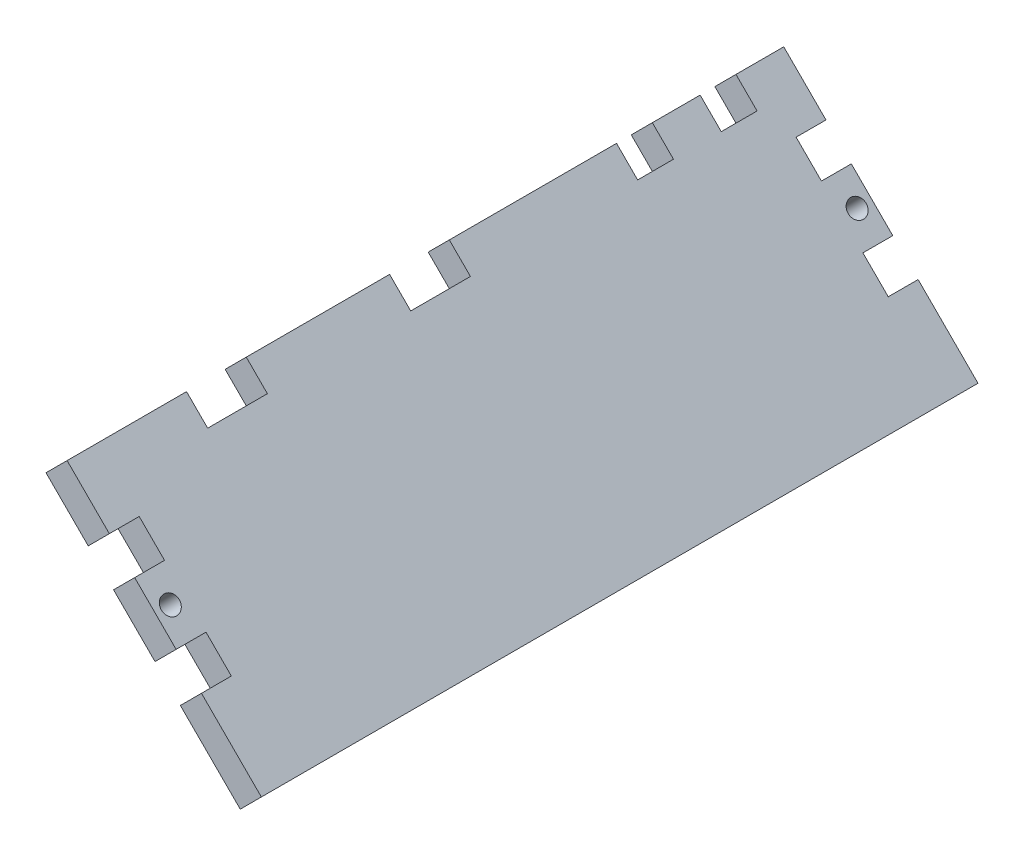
ISO-10303-21;
HEADER;
FILE_DESCRIPTION(('STEP AP214'),'2;1');
FILE_NAME('part.step','',(''),(''),'','','');
FILE_SCHEMA(('AUTOMOTIVE_DESIGN { 1 0 10303 214 1 1 1 1 }'));
ENDSEC;
DATA;
#1=APPLICATION_CONTEXT('core data for automotive mechanical design processes');
#2=APPLICATION_PROTOCOL_DEFINITION('international standard','automotive_design',2000,#1);
#3=PRODUCT_CONTEXT('',#1,'mechanical');
#4=PRODUCT('Part','Part','',(#3));
#5=PRODUCT_RELATED_PRODUCT_CATEGORY('part','',(#4));
#6=PRODUCT_DEFINITION_FORMATION('','',#4);
#7=PRODUCT_DEFINITION_CONTEXT('part definition',#1,'design');
#8=PRODUCT_DEFINITION('design','',#6,#7);
#9=PRODUCT_DEFINITION_SHAPE('','',#8);
#10=(LENGTH_UNIT() NAMED_UNIT(*) SI_UNIT(.MILLI.,.METRE.));
#11=(NAMED_UNIT(*) PLANE_ANGLE_UNIT() SI_UNIT($,.RADIAN.));
#12=(NAMED_UNIT(*) SI_UNIT($,.STERADIAN.) SOLID_ANGLE_UNIT());
#13=UNCERTAINTY_MEASURE_WITH_UNIT(LENGTH_MEASURE(1.E-05),#10,'distance_accuracy_value','');
#14=(GEOMETRIC_REPRESENTATION_CONTEXT(3) GLOBAL_UNCERTAINTY_ASSIGNED_CONTEXT((#13)) GLOBAL_UNIT_ASSIGNED_CONTEXT((#10,
#11,#12)) REPRESENTATION_CONTEXT('',''));
#15=CARTESIAN_POINT('',(0.,0.,0.));
#16=DIRECTION('',(0.,0.,1.));
#17=DIRECTION('',(1.,0.,0.));
#18=AXIS2_PLACEMENT_3D('',#15,#16,#17);
#19=CARTESIAN_POINT('',(-41.3091781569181,32.328922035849,0.));
#20=DIRECTION('',(-0.707106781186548,0.707106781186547,0.));
#21=DIRECTION('',(-0.707106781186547,-0.707106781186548,0.));
#22=AXIS2_PLACEMENT_3D('',#19,#20,#21);
#23=PLANE('',#22);
#24=DIRECTION('',(0.,0.,1.));
#25=VECTOR('',#24,1.);
#26=CARTESIAN_POINT('',(-36.8190500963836,36.8190500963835,0.));
#27=LINE('',#26,#25);
#28=CARTESIAN_POINT('',(-36.8190500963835,36.8190500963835,27.94));
#29=VERTEX_POINT('',#28);
#30=CARTESIAN_POINT('',(-36.8190500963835,36.8190500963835,35.56));
#31=VERTEX_POINT('',#30);
#32=EDGE_CURVE('E457',#29,#31,#27,.T.);
#33=ORIENTED_EDGE('',*,*,#32,.F.);
#34=DIRECTION('',(0.707106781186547,0.707106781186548,0.));
#35=VECTOR('',#34,1.);
#36=CARTESIAN_POINT('',(-41.3091781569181,32.328922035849,27.94));
#37=LINE('',#36,#35);
#38=CARTESIAN_POINT('',(-41.3091781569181,32.328922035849,27.94));
#39=VERTEX_POINT('',#38);
#40=EDGE_CURVE('E11',#39,#29,#37,.T.);
#41=ORIENTED_EDGE('',*,*,#40,.F.);
#42=DIRECTION('',(0.,0.,1.));
#43=VECTOR('',#42,1.);
#44=CARTESIAN_POINT('',(-41.3091781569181,32.328922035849,0.));
#45=LINE('',#44,#43);
#46=CARTESIAN_POINT('',(-41.3091781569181,32.328922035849,35.56));
#47=VERTEX_POINT('',#46);
#48=EDGE_CURVE('E331',#39,#47,#45,.T.);
#49=ORIENTED_EDGE('',*,*,#48,.T.);
#50=DIRECTION('',(0.707106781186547,0.707106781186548,0.));
#51=VECTOR('',#50,1.);
#52=CARTESIAN_POINT('',(-41.3091781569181,32.328922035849,35.56));
#53=LINE('',#52,#51);
#54=EDGE_CURVE('E183',#47,#31,#53,.T.);
#55=ORIENTED_EDGE('',*,*,#54,.T.);
#56=EDGE_LOOP('',(#33,#41,#49,#55));
#57=FACE_BOUND('',#56,.T.);
#58=ADVANCED_FACE('F47',(#57),#23,.T.);
#59=CARTESIAN_POINT('',(-4.49012806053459,-4.49012806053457,27.94));
#60=DIRECTION('',(0.,0.,1.));
#61=DIRECTION('',(1.,0.,0.));
#62=AXIS2_PLACEMENT_3D('',#59,#60,#61);
#63=PLANE('',#62);
#64=DIRECTION('',(0.707106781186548,-0.707106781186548,0.));
#65=VECTOR('',#64,1.);
#66=CARTESIAN_POINT('',(0.,0.,27.94));
#67=LINE('',#66,#65);
#68=CARTESIAN_POINT('',(-41.3091781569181,41.3091781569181,27.94));
#69=VERTEX_POINT('',#68);
#70=EDGE_CURVE('E452',#69,#29,#67,.T.);
#71=ORIENTED_EDGE('',*,*,#70,.F.);
#72=DIRECTION('',(0.707106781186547,0.707106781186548,0.));
#73=VECTOR('',#72,1.);
#74=CARTESIAN_POINT('',(-45.7993062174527,36.8190500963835,27.94));
#75=LINE('',#74,#73);
#76=CARTESIAN_POINT('',(-45.7993062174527,36.8190500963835,27.94));
#77=VERTEX_POINT('',#76);
#78=EDGE_CURVE('E57',#77,#69,#75,.T.);
#79=ORIENTED_EDGE('',*,*,#78,.F.);
#80=DIRECTION('',(0.707106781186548,-0.707106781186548,0.));
#81=VECTOR('',#80,1.);
#82=CARTESIAN_POINT('',(-4.49012806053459,-4.49012806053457,27.94));
#83=LINE('',#82,#81);
#84=EDGE_CURVE('E323',#77,#39,#83,.T.);
#85=ORIENTED_EDGE('',*,*,#84,.T.);
#86=ORIENTED_EDGE('',*,*,#40,.T.);
#87=EDGE_LOOP('',(#71,#79,#85,#86));
#88=FACE_BOUND('',#87,.T.);
#89=ADVANCED_FACE('F453',(#88),#63,.T.);
#90=CARTESIAN_POINT('',(-45.7993062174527,36.8190500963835,0.));
#91=DIRECTION('',(-0.707106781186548,0.707106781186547,0.));
#92=DIRECTION('',(-0.707106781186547,-0.707106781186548,0.));
#93=AXIS2_PLACEMENT_3D('',#90,#91,#92);
#94=PLANE('',#93);
#95=DIRECTION('',(0.,0.,1.));
#96=VECTOR('',#95,1.);
#97=CARTESIAN_POINT('',(-41.3091781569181,41.3091781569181,0.));
#98=LINE('',#97,#96);
#99=CARTESIAN_POINT('',(-41.3091781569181,41.3091781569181,17.78));
#100=VERTEX_POINT('',#99);
#101=EDGE_CURVE('E448',#100,#69,#98,.T.);
#102=ORIENTED_EDGE('',*,*,#101,.F.);
#103=DIRECTION('',(0.707106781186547,0.707106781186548,0.));
#104=VECTOR('',#103,1.);
#105=CARTESIAN_POINT('',(-45.7993062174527,36.8190500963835,17.78));
#106=LINE('',#105,#104);
#107=CARTESIAN_POINT('',(-45.7993062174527,36.8190500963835,17.78));
#108=VERTEX_POINT('',#107);
#109=EDGE_CURVE('E441',#108,#100,#106,.T.);
#110=ORIENTED_EDGE('',*,*,#109,.F.);
#111=DIRECTION('',(0.,0.,1.));
#112=VECTOR('',#111,1.);
#113=CARTESIAN_POINT('',(-45.7993062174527,36.8190500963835,0.));
#114=LINE('',#113,#112);
#115=EDGE_CURVE('E310',#108,#77,#114,.T.);
#116=ORIENTED_EDGE('',*,*,#115,.T.);
#117=ORIENTED_EDGE('',*,*,#78,.T.);
#118=EDGE_LOOP('',(#102,#110,#116,#117));
#119=FACE_BOUND('',#118,.T.);
#120=ADVANCED_FACE('F446',(#119),#94,.T.);
#121=CARTESIAN_POINT('',(-4.49012806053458,-4.49012806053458,17.78));
#122=DIRECTION('',(0.,0.,1.));
#123=DIRECTION('',(1.,0.,0.));
#124=AXIS2_PLACEMENT_3D('',#121,#122,#123);
#125=PLANE('',#124);
#126=DIRECTION('',(0.707106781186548,-0.707106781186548,0.));
#127=VECTOR('',#126,1.);
#128=CARTESIAN_POINT('',(0.,0.,17.78));
#129=LINE('',#128,#127);
#130=CARTESIAN_POINT('',(-36.8190500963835,36.8190500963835,17.78));
#131=VERTEX_POINT('',#130);
#132=EDGE_CURVE('E462',#100,#131,#129,.T.);
#133=ORIENTED_EDGE('',*,*,#132,.T.);
#134=DIRECTION('',(0.707106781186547,0.707106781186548,0.));
#135=VECTOR('',#134,1.);
#136=CARTESIAN_POINT('',(-41.3091781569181,32.328922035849,17.78));
#137=LINE('',#136,#135);
#138=CARTESIAN_POINT('',(-41.3091781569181,32.328922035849,17.78));
#139=VERTEX_POINT('',#138);
#140=EDGE_CURVE('E416',#139,#131,#137,.T.);
#141=ORIENTED_EDGE('',*,*,#140,.F.);
#142=DIRECTION('',(0.707106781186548,-0.707106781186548,0.));
#143=VECTOR('',#142,1.);
#144=CARTESIAN_POINT('',(-4.49012806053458,-4.49012806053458,17.78));
#145=LINE('',#144,#143);
#146=EDGE_CURVE('E322',#108,#139,#145,.T.);
#147=ORIENTED_EDGE('',*,*,#146,.F.);
#148=ORIENTED_EDGE('',*,*,#109,.T.);
#149=EDGE_LOOP('',(#133,#141,#147,#148));
#150=FACE_BOUND('',#149,.T.);
#151=ADVANCED_FACE('F847',(#150),#125,.F.);
#152=CARTESIAN_POINT('',(-41.3091781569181,32.3289220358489,0.));
#153=DIRECTION('',(-0.707106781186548,0.707106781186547,0.));
#154=DIRECTION('',(-0.707106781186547,-0.707106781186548,0.));
#155=AXIS2_PLACEMENT_3D('',#152,#153,#154);
#156=PLANE('',#155);
#157=DIRECTION('',(0.,0.,1.));
#158=VECTOR('',#157,1.);
#159=CARTESIAN_POINT('',(-36.8190500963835,36.8190500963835,0.));
#160=LINE('',#159,#158);
#161=CARTESIAN_POINT('',(-36.8190500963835,36.8190500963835,10.16));
#162=VERTEX_POINT('',#161);
#163=EDGE_CURVE('E468',#162,#131,#160,.T.);
#164=ORIENTED_EDGE('',*,*,#163,.F.);
#165=DIRECTION('',(0.707106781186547,0.707106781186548,0.));
#166=VECTOR('',#165,1.);
#167=CARTESIAN_POINT('',(-41.3091781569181,32.328922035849,10.16));
#168=LINE('',#167,#166);
#169=CARTESIAN_POINT('',(-41.3091781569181,32.328922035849,10.16));
#170=VERTEX_POINT('',#169);
#171=EDGE_CURVE('E418',#170,#162,#168,.T.);
#172=ORIENTED_EDGE('',*,*,#171,.F.);
#173=DIRECTION('',(0.,0.,1.));
#174=VECTOR('',#173,1.);
#175=CARTESIAN_POINT('',(-41.3091781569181,32.3289220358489,0.));
#176=LINE('',#175,#174);
#177=EDGE_CURVE('E329',#170,#139,#176,.T.);
#178=ORIENTED_EDGE('',*,*,#177,.T.);
#179=ORIENTED_EDGE('',*,*,#140,.T.);
#180=EDGE_LOOP('',(#164,#172,#178,#179));
#181=FACE_BOUND('',#180,.T.);
#182=ADVANCED_FACE('F414',(#181),#156,.T.);
#183=CARTESIAN_POINT('',(-4.49012806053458,-4.49012806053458,10.16));
#184=DIRECTION('',(0.,0.,1.));
#185=DIRECTION('',(1.,0.,0.));
#186=AXIS2_PLACEMENT_3D('',#183,#184,#185);
#187=PLANE('',#186);
#188=DIRECTION('',(0.707106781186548,-0.707106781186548,0.));
#189=VECTOR('',#188,1.);
#190=CARTESIAN_POINT('',(0.,0.,10.16));
#191=LINE('',#190,#189);
#192=CARTESIAN_POINT('',(-41.3091781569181,41.3091781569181,10.16));
#193=VERTEX_POINT('',#192);
#194=EDGE_CURVE('E426',#193,#162,#191,.T.);
#195=ORIENTED_EDGE('',*,*,#194,.F.);
#196=DIRECTION('',(0.707106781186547,0.707106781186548,0.));
#197=VECTOR('',#196,1.);
#198=CARTESIAN_POINT('',(-45.7993062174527,36.8190500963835,10.16));
#199=LINE('',#198,#197);
#200=CARTESIAN_POINT('',(-45.7993062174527,36.8190500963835,10.16));
#201=VERTEX_POINT('',#200);
#202=EDGE_CURVE('E424',#201,#193,#199,.T.);
#203=ORIENTED_EDGE('',*,*,#202,.F.);
#204=DIRECTION('',(0.707106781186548,-0.707106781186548,0.));
#205=VECTOR('',#204,1.);
#206=CARTESIAN_POINT('',(-4.49012806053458,-4.49012806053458,10.16));
#207=LINE('',#206,#205);
#208=EDGE_CURVE('E335',#201,#170,#207,.T.);
#209=ORIENTED_EDGE('',*,*,#208,.T.);
#210=ORIENTED_EDGE('',*,*,#171,.T.);
#211=EDGE_LOOP('',(#195,#203,#209,#210));
#212=FACE_BOUND('',#211,.T.);
#213=ADVANCED_FACE('F423',(#212),#187,.T.);
#214=CARTESIAN_POINT('',(-41.3091781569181,41.3091781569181,0.));
#215=VERTEX_POINT('',#214);
#216=EDGE_CURVE('E466',#215,#193,#98,.T.);
#217=ORIENTED_EDGE('',*,*,#216,.F.);
#218=DIRECTION('',(0.707106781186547,0.707106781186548,0.));
#219=VECTOR('',#218,1.);
#220=CARTESIAN_POINT('',(-45.7993062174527,36.8190500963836,0.));
#221=LINE('',#220,#219);
#222=CARTESIAN_POINT('',(-45.7993062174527,36.8190500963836,0.));
#223=VERTEX_POINT('',#222);
#224=EDGE_CURVE('E430',#223,#215,#221,.T.);
#225=ORIENTED_EDGE('',*,*,#224,.F.);
#226=EDGE_CURVE('E324',#223,#201,#114,.T.);
#227=ORIENTED_EDGE('',*,*,#226,.T.);
#228=ORIENTED_EDGE('',*,*,#202,.T.);
#229=EDGE_LOOP('',(#217,#225,#227,#228));
#230=FACE_BOUND('',#229,.T.);
#231=ADVANCED_FACE('F619',(#230),#94,.T.);
#232=CARTESIAN_POINT('',(-4.49012806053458,-4.49012806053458,0.));
#233=DIRECTION('',(0.,0.,1.));
#234=DIRECTION('',(0.,-1.,0.));
#235=AXIS2_PLACEMENT_3D('',#232,#233,#234);
#236=PLANE('',#235);
#237=DIRECTION('',(0.707106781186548,-0.707106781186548,0.));
#238=VECTOR('',#237,1.);
#239=CARTESIAN_POINT('',(0.,0.,0.));
#240=LINE('',#239,#238);
#241=CARTESIAN_POINT('',(-32.328922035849,32.328922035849,0.));
#242=VERTEX_POINT('',#241);
#243=EDGE_CURVE('E474',#215,#242,#240,.T.);
#244=ORIENTED_EDGE('',*,*,#243,.T.);
#245=DIRECTION('',(0.707106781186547,0.707106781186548,0.));
#246=VECTOR('',#245,1.);
#247=CARTESIAN_POINT('',(-36.8190500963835,27.8387939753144,0.));
#248=LINE('',#247,#246);
#249=CARTESIAN_POINT('',(-36.8190500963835,27.8387939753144,0.));
#250=VERTEX_POINT('',#249);
#251=EDGE_CURVE('E435',#250,#242,#248,.T.);
#252=ORIENTED_EDGE('',*,*,#251,.F.);
#253=DIRECTION('',(0.707106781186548,-0.707106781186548,0.));
#254=VECTOR('',#253,1.);
#255=CARTESIAN_POINT('',(-4.49012806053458,-4.49012806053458,0.));
#256=LINE('',#255,#254);
#257=EDGE_CURVE('E334',#223,#250,#256,.T.);
#258=ORIENTED_EDGE('',*,*,#257,.F.);
#259=ORIENTED_EDGE('',*,*,#224,.T.);
#260=EDGE_LOOP('',(#244,#252,#258,#259));
#261=FACE_BOUND('',#260,.T.);
#262=ADVANCED_FACE('F618',(#261),#236,.F.);
#263=CARTESIAN_POINT('',(-36.8190500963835,27.8387939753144,0.));
#264=DIRECTION('',(-0.707106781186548,0.707106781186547,0.));
#265=DIRECTION('',(-0.707106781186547,-0.707106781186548,0.));
#266=AXIS2_PLACEMENT_3D('',#263,#264,#265);
#267=PLANE('',#266);
#268=DIRECTION('',(0.,0.,1.));
#269=VECTOR('',#268,1.);
#270=CARTESIAN_POINT('',(-32.328922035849,32.3289220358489,0.));
#271=LINE('',#270,#269);
#272=CARTESIAN_POINT('',(-32.3289220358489,32.328922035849,6.35));
#273=VERTEX_POINT('',#272);
#274=EDGE_CURVE('E480',#242,#273,#271,.T.);
#275=ORIENTED_EDGE('',*,*,#274,.T.);
#276=DIRECTION('',(0.707106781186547,0.707106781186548,0.));
#277=VECTOR('',#276,1.);
#278=CARTESIAN_POINT('',(-36.8190500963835,27.8387939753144,6.35));
#279=LINE('',#278,#277);
#280=CARTESIAN_POINT('',(-36.8190500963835,27.8387939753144,6.35));
#281=VERTEX_POINT('',#280);
#282=EDGE_CURVE('E606',#281,#273,#279,.T.);
#283=ORIENTED_EDGE('',*,*,#282,.F.);
#284=DIRECTION('',(0.,0.,1.));
#285=VECTOR('',#284,1.);
#286=CARTESIAN_POINT('',(-36.8190500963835,27.8387939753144,0.));
#287=LINE('',#286,#285);
#288=EDGE_CURVE('E341',#250,#281,#287,.T.);
#289=ORIENTED_EDGE('',*,*,#288,.F.);
#290=ORIENTED_EDGE('',*,*,#251,.T.);
#291=EDGE_LOOP('',(#275,#283,#289,#290));
#292=FACE_BOUND('',#291,.T.);
#293=ADVANCED_FACE('F613',(#292),#267,.F.);
#294=CARTESIAN_POINT('',(-4.49012806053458,-4.49012806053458,6.34999999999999));
#295=DIRECTION('',(0.,0.,-1.));
#296=DIRECTION('',(0.,1.,0.));
#297=AXIS2_PLACEMENT_3D('',#294,#295,#296);
#298=PLANE('',#297);
#299=DIRECTION('',(-0.707106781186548,0.707106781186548,0.));
#300=VECTOR('',#299,1.);
#301=CARTESIAN_POINT('',(0.,0.,6.34999999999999));
#302=LINE('',#301,#300);
#303=CARTESIAN_POINT('',(-26.9407683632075,26.9407683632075,6.35000000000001));
#304=VERTEX_POINT('',#303);
#305=EDGE_CURVE('E625',#304,#273,#302,.T.);
#306=ORIENTED_EDGE('',*,*,#305,.F.);
#307=DIRECTION('',(0.707106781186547,0.707106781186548,0.));
#308=VECTOR('',#307,1.);
#309=CARTESIAN_POINT('',(-31.430896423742,22.4506403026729,6.35000000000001));
#310=LINE('',#309,#308);
#311=CARTESIAN_POINT('',(-31.430896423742,22.4506403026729,6.35000000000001));
#312=VERTEX_POINT('',#311);
#313=EDGE_CURVE('E603',#312,#304,#310,.T.);
#314=ORIENTED_EDGE('',*,*,#313,.F.);
#315=DIRECTION('',(-0.707106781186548,0.707106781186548,0.));
#316=VECTOR('',#315,1.);
#317=CARTESIAN_POINT('',(-4.49012806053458,-4.49012806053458,6.34999999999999));
#318=LINE('',#317,#316);
#319=EDGE_CURVE('E403',#312,#281,#318,.T.);
#320=ORIENTED_EDGE('',*,*,#319,.T.);
#321=ORIENTED_EDGE('',*,*,#282,.T.);
#322=EDGE_LOOP('',(#306,#314,#320,#321));
#323=FACE_BOUND('',#322,.T.);
#324=ADVANCED_FACE('F624',(#323),#298,.T.);
#325=CARTESIAN_POINT('',(-31.430896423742,22.4506403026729,0.));
#326=DIRECTION('',(-0.707106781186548,0.707106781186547,0.));
#327=DIRECTION('',(-0.707106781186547,-0.707106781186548,0.));
#328=AXIS2_PLACEMENT_3D('',#325,#326,#327);
#329=PLANE('',#328);
#330=DIRECTION('',(0.,0.,1.));
#331=VECTOR('',#330,1.);
#332=CARTESIAN_POINT('',(-26.9407683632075,26.9407683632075,0.));
#333=LINE('',#332,#331);
#334=CARTESIAN_POINT('',(-26.9407683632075,26.9407683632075,0.));
#335=VERTEX_POINT('',#334);
#336=EDGE_CURVE('E630',#335,#304,#333,.T.);
#337=ORIENTED_EDGE('',*,*,#336,.F.);
#338=DIRECTION('',(0.707106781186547,0.707106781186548,0.));
#339=VECTOR('',#338,1.);
#340=CARTESIAN_POINT('',(-31.430896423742,22.4506403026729,0.));
#341=LINE('',#340,#339);
#342=CARTESIAN_POINT('',(-31.430896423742,22.4506403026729,0.));
#343=VERTEX_POINT('',#342);
#344=EDGE_CURVE('E600',#343,#335,#341,.T.);
#345=ORIENTED_EDGE('',*,*,#344,.F.);
#346=DIRECTION('',(0.,0.,1.));
#347=VECTOR('',#346,1.);
#348=CARTESIAN_POINT('',(-31.430896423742,22.4506403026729,0.));
#349=LINE('',#348,#347);
#350=EDGE_CURVE('E399',#343,#312,#349,.T.);
#351=ORIENTED_EDGE('',*,*,#350,.T.);
#352=ORIENTED_EDGE('',*,*,#313,.T.);
#353=EDGE_LOOP('',(#337,#345,#351,#352));
#354=FACE_BOUND('',#353,.T.);
#355=ADVANCED_FACE('F629',(#354),#329,.T.);
#356=CARTESIAN_POINT('',(-18.1239529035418,18.1239529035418,0.));
#357=VERTEX_POINT('',#356);
#358=EDGE_CURVE('E483',#335,#357,#240,.T.);
#359=ORIENTED_EDGE('',*,*,#358,.T.);
#360=DIRECTION('',(0.707106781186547,0.707106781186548,0.));
#361=VECTOR('',#360,1.);
#362=CARTESIAN_POINT('',(-22.6140809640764,13.6338248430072,0.));
#363=LINE('',#362,#361);
#364=CARTESIAN_POINT('',(-22.6140809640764,13.6338248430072,0.));
#365=VERTEX_POINT('',#364);
#366=EDGE_CURVE('E596',#365,#357,#363,.T.);
#367=ORIENTED_EDGE('',*,*,#366,.F.);
#368=EDGE_CURVE('E344',#343,#365,#256,.T.);
#369=ORIENTED_EDGE('',*,*,#368,.F.);
#370=ORIENTED_EDGE('',*,*,#344,.T.);
#371=EDGE_LOOP('',(#359,#367,#369,#370));
#372=FACE_BOUND('',#371,.T.);
#373=ADVANCED_FACE('F639',(#372),#236,.F.);
#374=CARTESIAN_POINT('',(-22.6140809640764,13.6338248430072,0.));
#375=DIRECTION('',(-0.707106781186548,0.707106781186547,0.));
#376=DIRECTION('',(-0.707106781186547,-0.707106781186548,0.));
#377=AXIS2_PLACEMENT_3D('',#374,#375,#376);
#378=PLANE('',#377);
#379=DIRECTION('',(0.,0.,1.));
#380=VECTOR('',#379,1.);
#381=CARTESIAN_POINT('',(-18.1239529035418,18.1239529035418,0.));
#382=LINE('',#381,#380);
#383=CARTESIAN_POINT('',(-18.1239529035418,18.1239529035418,6.35));
#384=VERTEX_POINT('',#383);
#385=EDGE_CURVE('E644',#357,#384,#382,.T.);
#386=ORIENTED_EDGE('',*,*,#385,.T.);
#387=DIRECTION('',(0.707106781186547,0.707106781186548,0.));
#388=VECTOR('',#387,1.);
#389=CARTESIAN_POINT('',(-22.6140809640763,13.6338248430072,6.35));
#390=LINE('',#389,#388);
#391=CARTESIAN_POINT('',(-22.6140809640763,13.6338248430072,6.35));
#392=VERTEX_POINT('',#391);
#393=EDGE_CURVE('E593',#392,#384,#390,.T.);
#394=ORIENTED_EDGE('',*,*,#393,.F.);
#395=DIRECTION('',(0.,0.,1.));
#396=VECTOR('',#395,1.);
#397=CARTESIAN_POINT('',(-22.6140809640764,13.6338248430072,0.));
#398=LINE('',#397,#396);
#399=EDGE_CURVE('E396',#365,#392,#398,.T.);
#400=ORIENTED_EDGE('',*,*,#399,.F.);
#401=ORIENTED_EDGE('',*,*,#366,.T.);
#402=EDGE_LOOP('',(#386,#394,#400,#401));
#403=FACE_BOUND('',#402,.T.);
#404=ADVANCED_FACE('F643',(#403),#378,.F.);
#405=CARTESIAN_POINT('',(-4.49012806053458,-4.49012806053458,6.35));
#406=DIRECTION('',(0.,0.,-1.));
#407=DIRECTION('',(0.,1.,0.));
#408=AXIS2_PLACEMENT_3D('',#405,#406,#407);
#409=PLANE('',#408);
#410=DIRECTION('',(-0.707106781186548,0.707106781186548,0.));
#411=VECTOR('',#410,1.);
#412=CARTESIAN_POINT('',(0.,0.,6.35));
#413=LINE('',#412,#411);
#414=CARTESIAN_POINT('',(-12.7357992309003,12.7357992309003,6.35000000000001));
#415=VERTEX_POINT('',#414);
#416=EDGE_CURVE('E864',#415,#384,#413,.T.);
#417=ORIENTED_EDGE('',*,*,#416,.F.);
#418=DIRECTION('',(0.707106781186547,0.707106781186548,0.));
#419=VECTOR('',#418,1.);
#420=CARTESIAN_POINT('',(-17.2259272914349,8.2456711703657,6.35000000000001));
#421=LINE('',#420,#419);
#422=CARTESIAN_POINT('',(-17.2259272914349,8.2456711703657,6.35000000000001));
#423=VERTEX_POINT('',#422);
#424=EDGE_CURVE('E590',#423,#415,#421,.T.);
#425=ORIENTED_EDGE('',*,*,#424,.F.);
#426=DIRECTION('',(-0.707106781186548,0.707106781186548,0.));
#427=VECTOR('',#426,1.);
#428=CARTESIAN_POINT('',(-4.49012806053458,-4.49012806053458,6.35));
#429=LINE('',#428,#427);
#430=EDGE_CURVE('E392',#423,#392,#429,.T.);
#431=ORIENTED_EDGE('',*,*,#430,.T.);
#432=ORIENTED_EDGE('',*,*,#393,.T.);
#433=EDGE_LOOP('',(#417,#425,#431,#432));
#434=FACE_BOUND('',#433,.T.);
#435=ADVANCED_FACE('F648',(#434),#409,.T.);
#436=CARTESIAN_POINT('',(-17.2259272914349,8.2456711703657,0.));
#437=DIRECTION('',(-0.707106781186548,0.707106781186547,0.));
#438=DIRECTION('',(-0.707106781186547,-0.707106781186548,0.));
#439=AXIS2_PLACEMENT_3D('',#436,#437,#438);
#440=PLANE('',#439);
#441=DIRECTION('',(0.,0.,1.));
#442=VECTOR('',#441,1.);
#443=CARTESIAN_POINT('',(-12.7357992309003,12.7357992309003,0.));
#444=LINE('',#443,#442);
#445=CARTESIAN_POINT('',(-12.7357992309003,12.7357992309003,0.));
#446=VERTEX_POINT('',#445);
#447=EDGE_CURVE('E655',#446,#415,#444,.T.);
#448=ORIENTED_EDGE('',*,*,#447,.F.);
#449=DIRECTION('',(0.707106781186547,0.707106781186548,0.));
#450=VECTOR('',#449,1.);
#451=CARTESIAN_POINT('',(-17.2259272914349,8.2456711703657,0.));
#452=LINE('',#451,#450);
#453=CARTESIAN_POINT('',(-17.2259272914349,8.2456711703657,0.));
#454=VERTEX_POINT('',#453);
#455=EDGE_CURVE('E587',#454,#446,#452,.T.);
#456=ORIENTED_EDGE('',*,*,#455,.F.);
#457=DIRECTION('',(0.,0.,1.));
#458=VECTOR('',#457,1.);
#459=CARTESIAN_POINT('',(-17.2259272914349,8.2456711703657,0.));
#460=LINE('',#459,#458);
#461=EDGE_CURVE('E387',#454,#423,#460,.T.);
#462=ORIENTED_EDGE('',*,*,#461,.T.);
#463=ORIENTED_EDGE('',*,*,#424,.T.);
#464=EDGE_LOOP('',(#448,#456,#462,#463));
#465=FACE_BOUND('',#464,.T.);
#466=ADVANCED_FACE('F652',(#465),#440,.T.);
#467=CARTESIAN_POINT('',(0.,0.,0.));
#468=VERTEX_POINT('',#467);
#469=EDGE_CURVE('E482',#446,#468,#240,.T.);
#470=ORIENTED_EDGE('',*,*,#469,.T.);
#471=DIRECTION('',(0.707106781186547,0.707106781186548,0.));
#472=VECTOR('',#471,1.);
#473=CARTESIAN_POINT('',(-4.49012806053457,-4.49012806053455,0.));
#474=LINE('',#473,#472);
#475=CARTESIAN_POINT('',(-4.49012806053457,-4.49012806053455,0.));
#476=VERTEX_POINT('',#475);
#477=EDGE_CURVE('E583',#476,#468,#474,.T.);
#478=ORIENTED_EDGE('',*,*,#477,.F.);
#479=EDGE_CURVE('E343',#454,#476,#256,.T.);
#480=ORIENTED_EDGE('',*,*,#479,.F.);
#481=ORIENTED_EDGE('',*,*,#455,.T.);
#482=EDGE_LOOP('',(#470,#478,#480,#481));
#483=FACE_BOUND('',#482,.T.);
#484=ADVANCED_FACE('F660',(#483),#236,.F.);
#485=CARTESIAN_POINT('',(-4.49012806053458,-4.49012806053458,0.));
#486=DIRECTION('',(-0.707106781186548,0.707106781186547,0.));
#487=DIRECTION('',(-0.707106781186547,-0.707106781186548,0.));
#488=AXIS2_PLACEMENT_3D('',#485,#486,#487);
#489=PLANE('',#488);
#490=DIRECTION('',(0.,0.,1.));
#491=VECTOR('',#490,1.);
#492=CARTESIAN_POINT('',(0.,0.,0.));
#493=LINE('',#492,#491);
#494=CARTESIAN_POINT('',(0.,0.,152.4));
#495=VERTEX_POINT('',#494);
#496=EDGE_CURVE('E664',#468,#495,#493,.T.);
#497=ORIENTED_EDGE('',*,*,#496,.T.);
#498=DIRECTION('',(0.707106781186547,0.707106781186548,0.));
#499=VECTOR('',#498,1.);
#500=CARTESIAN_POINT('',(-4.49012806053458,-4.49012806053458,152.4));
#501=LINE('',#500,#499);
#502=CARTESIAN_POINT('',(-4.49012806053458,-4.49012806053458,152.4));
#503=VERTEX_POINT('',#502);
#504=EDGE_CURVE('E580',#503,#495,#501,.T.);
#505=ORIENTED_EDGE('',*,*,#504,.F.);
#506=DIRECTION('',(0.,0.,1.));
#507=VECTOR('',#506,1.);
#508=CARTESIAN_POINT('',(-4.49012806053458,-4.49012806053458,0.));
#509=LINE('',#508,#507);
#510=EDGE_CURVE('E377',#476,#503,#509,.T.);
#511=ORIENTED_EDGE('',*,*,#510,.F.);
#512=ORIENTED_EDGE('',*,*,#477,.T.);
#513=EDGE_LOOP('',(#497,#505,#511,#512));
#514=FACE_BOUND('',#513,.T.);
#515=ADVANCED_FACE('F663',(#514),#489,.F.);
#516=CARTESIAN_POINT('',(-4.49012806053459,-4.49012806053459,152.4));
#517=DIRECTION('',(0.,0.,1.));
#518=DIRECTION('',(0.,-1.,0.));
#519=AXIS2_PLACEMENT_3D('',#516,#517,#518);
#520=PLANE('',#519);
#521=DIRECTION('',(0.707106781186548,-0.707106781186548,0.));
#522=VECTOR('',#521,1.);
#523=CARTESIAN_POINT('',(0.,0.,152.4));
#524=LINE('',#523,#522);
#525=CARTESIAN_POINT('',(-12.7357992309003,12.7357992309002,152.4));
#526=VERTEX_POINT('',#525);
#527=EDGE_CURVE('E500',#526,#495,#524,.T.);
#528=ORIENTED_EDGE('',*,*,#527,.F.);
#529=DIRECTION('',(0.707106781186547,0.707106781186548,0.));
#530=VECTOR('',#529,1.);
#531=CARTESIAN_POINT('',(-17.2259272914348,8.24567117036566,152.4));
#532=LINE('',#531,#530);
#533=CARTESIAN_POINT('',(-17.2259272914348,8.24567117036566,152.4));
#534=VERTEX_POINT('',#533);
#535=EDGE_CURVE('E577',#534,#526,#532,.T.);
#536=ORIENTED_EDGE('',*,*,#535,.F.);
#537=DIRECTION('',(0.707106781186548,-0.707106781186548,0.));
#538=VECTOR('',#537,1.);
#539=CARTESIAN_POINT('',(-4.49012806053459,-4.49012806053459,152.4));
#540=LINE('',#539,#538);
#541=EDGE_CURVE('E361',#534,#503,#540,.T.);
#542=ORIENTED_EDGE('',*,*,#541,.T.);
#543=ORIENTED_EDGE('',*,*,#504,.T.);
#544=EDGE_LOOP('',(#528,#536,#542,#543));
#545=FACE_BOUND('',#544,.T.);
#546=ADVANCED_FACE('F667',(#545),#520,.T.);
#547=CARTESIAN_POINT('',(-17.2259272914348,8.24567117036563,0.));
#548=DIRECTION('',(0.707106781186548,-0.707106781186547,0.));
#549=DIRECTION('',(0.707106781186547,0.707106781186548,0.));
#550=AXIS2_PLACEMENT_3D('',#547,#548,#549);
#551=PLANE('',#550);
#552=DIRECTION('',(0.,0.,-1.));
#553=VECTOR('',#552,1.);
#554=CARTESIAN_POINT('',(-12.7357992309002,12.7357992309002,0.));
#555=LINE('',#554,#553);
#556=CARTESIAN_POINT('',(-12.7357992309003,12.7357992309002,146.05));
#557=VERTEX_POINT('',#556);
#558=EDGE_CURVE('E671',#526,#557,#555,.T.);
#559=ORIENTED_EDGE('',*,*,#558,.T.);
#560=DIRECTION('',(0.707106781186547,0.707106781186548,0.));
#561=VECTOR('',#560,1.);
#562=CARTESIAN_POINT('',(-17.2259272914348,8.24567117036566,146.05));
#563=LINE('',#562,#561);
#564=CARTESIAN_POINT('',(-17.2259272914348,8.24567117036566,146.05));
#565=VERTEX_POINT('',#564);
#566=EDGE_CURVE('E573',#565,#557,#563,.T.);
#567=ORIENTED_EDGE('',*,*,#566,.F.);
#568=DIRECTION('',(0.,0.,-1.));
#569=VECTOR('',#568,1.);
#570=CARTESIAN_POINT('',(-17.2259272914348,8.24567117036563,0.));
#571=LINE('',#570,#569);
#572=EDGE_CURVE('E376',#534,#565,#571,.T.);
#573=ORIENTED_EDGE('',*,*,#572,.F.);
#574=ORIENTED_EDGE('',*,*,#535,.T.);
#575=EDGE_LOOP('',(#559,#567,#573,#574));
#576=FACE_BOUND('',#575,.T.);
#577=ADVANCED_FACE('F726',(#576),#551,.F.);
#578=CARTESIAN_POINT('',(-4.49012806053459,-4.49012806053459,146.05));
#579=DIRECTION('',(0.,0.,-1.));
#580=DIRECTION('',(-1.,0.,0.));
#581=AXIS2_PLACEMENT_3D('',#578,#579,#580);
#582=PLANE('',#581);
#583=DIRECTION('',(-0.707106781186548,0.707106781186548,0.));
#584=VECTOR('',#583,1.);
#585=CARTESIAN_POINT('',(0.,0.,146.05));
#586=LINE('',#585,#584);
#587=CARTESIAN_POINT('',(-18.1239529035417,18.1239529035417,146.05));
#588=VERTEX_POINT('',#587);
#589=EDGE_CURVE('E675',#557,#588,#586,.T.);
#590=ORIENTED_EDGE('',*,*,#589,.T.);
#591=DIRECTION('',(0.707106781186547,0.707106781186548,0.));
#592=VECTOR('',#591,1.);
#593=CARTESIAN_POINT('',(-22.6140809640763,13.6338248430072,146.05));
#594=LINE('',#593,#592);
#595=CARTESIAN_POINT('',(-22.6140809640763,13.6338248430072,146.05));
#596=VERTEX_POINT('',#595);
#597=EDGE_CURVE('E570',#596,#588,#594,.T.);
#598=ORIENTED_EDGE('',*,*,#597,.F.);
#599=DIRECTION('',(-0.707106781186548,0.707106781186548,0.));
#600=VECTOR('',#599,1.);
#601=CARTESIAN_POINT('',(-4.49012806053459,-4.49012806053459,146.05));
#602=LINE('',#601,#600);
#603=EDGE_CURVE('E383',#565,#596,#602,.T.);
#604=ORIENTED_EDGE('',*,*,#603,.F.);
#605=ORIENTED_EDGE('',*,*,#566,.T.);
#606=EDGE_LOOP('',(#590,#598,#604,#605));
#607=FACE_BOUND('',#606,.T.);
#608=ADVANCED_FACE('F723',(#607),#582,.F.);
#609=CARTESIAN_POINT('',(-22.6140809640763,13.6338248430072,0.));
#610=DIRECTION('',(0.707106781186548,-0.707106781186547,0.));
#611=DIRECTION('',(0.707106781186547,0.707106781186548,0.));
#612=AXIS2_PLACEMENT_3D('',#609,#610,#611);
#613=PLANE('',#612);
#614=DIRECTION('',(0.,0.,-1.));
#615=VECTOR('',#614,1.);
#616=CARTESIAN_POINT('',(-18.1239529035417,18.1239529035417,0.));
#617=LINE('',#616,#615);
#618=CARTESIAN_POINT('',(-18.1239529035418,18.1239529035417,152.4));
#619=VERTEX_POINT('',#618);
#620=EDGE_CURVE('E681',#619,#588,#617,.T.);
#621=ORIENTED_EDGE('',*,*,#620,.F.);
#622=DIRECTION('',(0.707106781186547,0.707106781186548,0.));
#623=VECTOR('',#622,1.);
#624=CARTESIAN_POINT('',(-22.6140809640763,13.6338248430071,152.4));
#625=LINE('',#624,#623);
#626=CARTESIAN_POINT('',(-22.6140809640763,13.6338248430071,152.4));
#627=VERTEX_POINT('',#626);
#628=EDGE_CURVE('E567',#627,#619,#625,.T.);
#629=ORIENTED_EDGE('',*,*,#628,.F.);
#630=DIRECTION('',(0.,0.,-1.));
#631=VECTOR('',#630,1.);
#632=CARTESIAN_POINT('',(-22.6140809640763,13.6338248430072,0.));
#633=LINE('',#632,#631);
#634=EDGE_CURVE('E373',#627,#596,#633,.T.);
#635=ORIENTED_EDGE('',*,*,#634,.T.);
#636=ORIENTED_EDGE('',*,*,#597,.T.);
#637=EDGE_LOOP('',(#621,#629,#635,#636));
#638=FACE_BOUND('',#637,.T.);
#639=ADVANCED_FACE('F720',(#638),#613,.T.);
#640=CARTESIAN_POINT('',(-26.9407683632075,26.9407683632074,152.4));
#641=VERTEX_POINT('',#640);
#642=EDGE_CURVE('E499',#641,#619,#524,.T.);
#643=ORIENTED_EDGE('',*,*,#642,.F.);
#644=DIRECTION('',(0.707106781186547,0.707106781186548,0.));
#645=VECTOR('',#644,1.);
#646=CARTESIAN_POINT('',(-31.430896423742,22.4506403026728,152.4));
#647=LINE('',#646,#645);
#648=CARTESIAN_POINT('',(-31.430896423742,22.4506403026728,152.4));
#649=VERTEX_POINT('',#648);
#650=EDGE_CURVE('E564',#649,#641,#647,.T.);
#651=ORIENTED_EDGE('',*,*,#650,.F.);
#652=EDGE_CURVE('E360',#649,#627,#540,.T.);
#653=ORIENTED_EDGE('',*,*,#652,.T.);
#654=ORIENTED_EDGE('',*,*,#628,.T.);
#655=EDGE_LOOP('',(#643,#651,#653,#654));
#656=FACE_BOUND('',#655,.T.);
#657=ADVANCED_FACE('F715',(#656),#520,.T.);
#658=CARTESIAN_POINT('',(-31.4308964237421,22.4506403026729,0.));
#659=DIRECTION('',(0.707106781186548,-0.707106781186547,0.));
#660=DIRECTION('',(0.707106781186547,0.707106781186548,0.));
#661=AXIS2_PLACEMENT_3D('',#658,#659,#660);
#662=PLANE('',#661);
#663=DIRECTION('',(0.,0.,-1.));
#664=VECTOR('',#663,1.);
#665=CARTESIAN_POINT('',(-26.9407683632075,26.9407683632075,0.));
#666=LINE('',#665,#664);
#667=CARTESIAN_POINT('',(-26.9407683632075,26.9407683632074,146.05));
#668=VERTEX_POINT('',#667);
#669=EDGE_CURVE('E680',#641,#668,#666,.T.);
#670=ORIENTED_EDGE('',*,*,#669,.T.);
#671=DIRECTION('',(0.707106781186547,0.707106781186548,0.));
#672=VECTOR('',#671,1.);
#673=CARTESIAN_POINT('',(-31.430896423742,22.4506403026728,146.05));
#674=LINE('',#673,#672);
#675=CARTESIAN_POINT('',(-31.430896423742,22.4506403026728,146.05));
#676=VERTEX_POINT('',#675);
#677=EDGE_CURVE('E560',#676,#668,#674,.T.);
#678=ORIENTED_EDGE('',*,*,#677,.F.);
#679=DIRECTION('',(0.,0.,-1.));
#680=VECTOR('',#679,1.);
#681=CARTESIAN_POINT('',(-31.4308964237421,22.4506403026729,0.));
#682=LINE('',#681,#680);
#683=EDGE_CURVE('E372',#649,#676,#682,.T.);
#684=ORIENTED_EDGE('',*,*,#683,.F.);
#685=ORIENTED_EDGE('',*,*,#650,.T.);
#686=EDGE_LOOP('',(#670,#678,#684,#685));
#687=FACE_BOUND('',#686,.T.);
#688=ADVANCED_FACE('F713',(#687),#662,.F.);
#689=CARTESIAN_POINT('',(-4.49012806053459,-4.49012806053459,146.05));
#690=DIRECTION('',(0.,0.,-1.));
#691=DIRECTION('',(-1.,0.,0.));
#692=AXIS2_PLACEMENT_3D('',#689,#690,#691);
#693=PLANE('',#692);
#694=DIRECTION('',(-0.707106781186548,0.707106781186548,0.));
#695=VECTOR('',#694,1.);
#696=CARTESIAN_POINT('',(0.,0.,146.05));
#697=LINE('',#696,#695);
#698=CARTESIAN_POINT('',(-32.3289220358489,32.3289220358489,146.05));
#699=VERTEX_POINT('',#698);
#700=EDGE_CURVE('E688',#668,#699,#697,.T.);
#701=ORIENTED_EDGE('',*,*,#700,.T.);
#702=DIRECTION('',(0.707106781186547,0.707106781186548,0.));
#703=VECTOR('',#702,1.);
#704=CARTESIAN_POINT('',(-36.8190500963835,27.8387939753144,146.05));
#705=LINE('',#704,#703);
#706=CARTESIAN_POINT('',(-36.8190500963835,27.8387939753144,146.05));
#707=VERTEX_POINT('',#706);
#708=EDGE_CURVE('E557',#707,#699,#705,.T.);
#709=ORIENTED_EDGE('',*,*,#708,.F.);
#710=DIRECTION('',(-0.707106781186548,0.707106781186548,0.));
#711=VECTOR('',#710,1.);
#712=CARTESIAN_POINT('',(-4.49012806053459,-4.49012806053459,146.05));
#713=LINE('',#712,#711);
#714=EDGE_CURVE('E366',#676,#707,#713,.T.);
#715=ORIENTED_EDGE('',*,*,#714,.F.);
#716=ORIENTED_EDGE('',*,*,#677,.T.);
#717=EDGE_LOOP('',(#701,#709,#715,#716));
#718=FACE_BOUND('',#717,.T.);
#719=ADVANCED_FACE('F708',(#718),#693,.F.);
#720=CARTESIAN_POINT('',(-36.8190500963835,27.8387939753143,0.));
#721=DIRECTION('',(0.707106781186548,-0.707106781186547,0.));
#722=DIRECTION('',(0.707106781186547,0.707106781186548,0.));
#723=AXIS2_PLACEMENT_3D('',#720,#721,#722);
#724=PLANE('',#723);
#725=DIRECTION('',(0.,0.,-1.));
#726=VECTOR('',#725,1.);
#727=CARTESIAN_POINT('',(-32.3289220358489,32.3289220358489,0.));
#728=LINE('',#727,#726);
#729=CARTESIAN_POINT('',(-32.3289220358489,32.3289220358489,152.4));
#730=VERTEX_POINT('',#729);
#731=EDGE_CURVE('E497',#730,#699,#728,.T.);
#732=ORIENTED_EDGE('',*,*,#731,.F.);
#733=DIRECTION('',(0.707106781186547,0.707106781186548,0.));
#734=VECTOR('',#733,1.);
#735=CARTESIAN_POINT('',(-36.8190500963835,27.8387939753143,152.4));
#736=LINE('',#735,#734);
#737=CARTESIAN_POINT('',(-36.8190500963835,27.8387939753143,152.4));
#738=VERTEX_POINT('',#737);
#739=EDGE_CURVE('E554',#738,#730,#736,.T.);
#740=ORIENTED_EDGE('',*,*,#739,.F.);
#741=DIRECTION('',(0.,0.,-1.));
#742=VECTOR('',#741,1.);
#743=CARTESIAN_POINT('',(-36.8190500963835,27.8387939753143,0.));
#744=LINE('',#743,#742);
#745=EDGE_CURVE('E358',#738,#707,#744,.T.);
#746=ORIENTED_EDGE('',*,*,#745,.T.);
#747=ORIENTED_EDGE('',*,*,#708,.T.);
#748=EDGE_LOOP('',(#732,#740,#746,#747));
#749=FACE_BOUND('',#748,.T.);
#750=ADVANCED_FACE('F704',(#749),#724,.T.);
#751=CARTESIAN_POINT('',(-41.3091781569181,41.3091781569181,152.4));
#752=VERTEX_POINT('',#751);
#753=EDGE_CURVE('E488',#752,#730,#524,.T.);
#754=ORIENTED_EDGE('',*,*,#753,.F.);
#755=DIRECTION('',(0.707106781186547,0.707106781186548,0.));
#756=VECTOR('',#755,1.);
#757=CARTESIAN_POINT('',(-45.7993062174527,36.8190500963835,152.4));
#758=LINE('',#757,#756);
#759=CARTESIAN_POINT('',(-45.7993062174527,36.8190500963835,152.4));
#760=VERTEX_POINT('',#759);
#761=EDGE_CURVE('E551',#760,#752,#758,.T.);
#762=ORIENTED_EDGE('',*,*,#761,.F.);
#763=EDGE_CURVE('E350',#760,#738,#540,.T.);
#764=ORIENTED_EDGE('',*,*,#763,.T.);
#765=ORIENTED_EDGE('',*,*,#739,.T.);
#766=EDGE_LOOP('',(#754,#762,#764,#765));
#767=FACE_BOUND('',#766,.T.);
#768=ADVANCED_FACE('F813',(#767),#520,.T.);
#769=CARTESIAN_POINT('',(-41.3091781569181,41.3091781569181,127.));
#770=VERTEX_POINT('',#769);
#771=EDGE_CURVE('E475',#770,#752,#98,.T.);
#772=ORIENTED_EDGE('',*,*,#771,.F.);
#773=DIRECTION('',(0.707106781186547,0.707106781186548,0.));
#774=VECTOR('',#773,1.);
#775=CARTESIAN_POINT('',(-45.7993062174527,36.8190500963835,127.));
#776=LINE('',#775,#774);
#777=CARTESIAN_POINT('',(-45.7993062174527,36.8190500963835,127.));
#778=VERTEX_POINT('',#777);
#779=EDGE_CURVE('E548',#778,#770,#776,.T.);
#780=ORIENTED_EDGE('',*,*,#779,.F.);
#781=EDGE_CURVE('E319',#778,#760,#114,.T.);
#782=ORIENTED_EDGE('',*,*,#781,.T.);
#783=ORIENTED_EDGE('',*,*,#761,.T.);
#784=EDGE_LOOP('',(#772,#780,#782,#783));
#785=FACE_BOUND('',#784,.T.);
#786=ADVANCED_FACE('F811',(#785),#94,.T.);
#787=CARTESIAN_POINT('',(-4.4901280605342,-4.49012806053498,127.));
#788=DIRECTION('',(0.,0.,1.));
#789=DIRECTION('',(0.,-1.,0.));
#790=AXIS2_PLACEMENT_3D('',#787,#788,#789);
#791=PLANE('',#790);
#792=DIRECTION('',(0.707106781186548,-0.707106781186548,0.));
#793=VECTOR('',#792,1.);
#794=CARTESIAN_POINT('',(3.78701476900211E-13,-4.06344752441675E-13,127.));
#795=LINE('',#794,#793);
#796=CARTESIAN_POINT('',(-36.8190500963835,36.8190500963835,127.));
#797=VERTEX_POINT('',#796);
#798=EDGE_CURVE('E487',#770,#797,#795,.T.);
#799=ORIENTED_EDGE('',*,*,#798,.T.);
#800=DIRECTION('',(0.707106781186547,0.707106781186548,0.));
#801=VECTOR('',#800,1.);
#802=CARTESIAN_POINT('',(-41.3091781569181,32.328922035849,127.));
#803=LINE('',#802,#801);
#804=CARTESIAN_POINT('',(-41.3091781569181,32.328922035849,127.));
#805=VERTEX_POINT('',#804);
#806=EDGE_CURVE('E545',#805,#797,#803,.T.);
#807=ORIENTED_EDGE('',*,*,#806,.F.);
#808=DIRECTION('',(0.707106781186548,-0.707106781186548,0.));
#809=VECTOR('',#808,1.);
#810=CARTESIAN_POINT('',(-4.4901280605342,-4.49012806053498,127.));
#811=LINE('',#810,#809);
#812=EDGE_CURVE('E349',#778,#805,#811,.T.);
#813=ORIENTED_EDGE('',*,*,#812,.F.);
#814=ORIENTED_EDGE('',*,*,#779,.T.);
#815=EDGE_LOOP('',(#799,#807,#813,#814));
#816=FACE_BOUND('',#815,.T.);
#817=ADVANCED_FACE('F807',(#816),#791,.F.);
#818=CARTESIAN_POINT('',(-41.3091781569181,32.328922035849,0.));
#819=DIRECTION('',(-0.707106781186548,0.707106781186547,0.));
#820=DIRECTION('',(-0.707106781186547,-0.707106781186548,0.));
#821=AXIS2_PLACEMENT_3D('',#818,#819,#820);
#822=PLANE('',#821);
#823=DIRECTION('',(0.,0.,1.));
#824=VECTOR('',#823,1.);
#825=CARTESIAN_POINT('',(-36.8190500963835,36.8190500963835,0.));
#826=LINE('',#825,#824);
#827=CARTESIAN_POINT('',(-36.8190500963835,36.8190500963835,114.3));
#828=VERTEX_POINT('',#827);
#829=EDGE_CURVE('E495',#828,#797,#826,.T.);
#830=ORIENTED_EDGE('',*,*,#829,.F.);
#831=DIRECTION('',(0.707106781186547,0.707106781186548,0.));
#832=VECTOR('',#831,1.);
#833=CARTESIAN_POINT('',(-41.3091781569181,32.328922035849,114.3));
#834=LINE('',#833,#832);
#835=CARTESIAN_POINT('',(-41.3091781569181,32.328922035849,114.3));
#836=VERTEX_POINT('',#835);
#837=EDGE_CURVE('E542',#836,#828,#834,.T.);
#838=ORIENTED_EDGE('',*,*,#837,.F.);
#839=DIRECTION('',(0.,0.,1.));
#840=VECTOR('',#839,1.);
#841=CARTESIAN_POINT('',(-41.3091781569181,32.328922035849,0.));
#842=LINE('',#841,#840);
#843=EDGE_CURVE('E355',#836,#805,#842,.T.);
#844=ORIENTED_EDGE('',*,*,#843,.T.);
#845=ORIENTED_EDGE('',*,*,#806,.T.);
#846=EDGE_LOOP('',(#830,#838,#844,#845));
#847=FACE_BOUND('',#846,.T.);
#848=ADVANCED_FACE('F803',(#847),#822,.T.);
#849=CARTESIAN_POINT('',(-4.49012806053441,-4.49012806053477,114.3));
#850=DIRECTION('',(0.,0.,1.));
#851=DIRECTION('',(0.,-1.,0.));
#852=AXIS2_PLACEMENT_3D('',#849,#850,#851);
#853=PLANE('',#852);
#854=DIRECTION('',(0.707106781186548,-0.707106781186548,0.));
#855=VECTOR('',#854,1.);
#856=CARTESIAN_POINT('',(1.63810772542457E-13,-1.89460030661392E-13,114.3));
#857=LINE('',#856,#855);
#858=CARTESIAN_POINT('',(-41.3091781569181,41.3091781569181,114.3));
#859=VERTEX_POINT('',#858);
#860=EDGE_CURVE('E504',#859,#828,#857,.T.);
#861=ORIENTED_EDGE('',*,*,#860,.F.);
#862=DIRECTION('',(0.707106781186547,0.707106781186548,0.));
#863=VECTOR('',#862,1.);
#864=CARTESIAN_POINT('',(-45.7993062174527,36.8190500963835,114.3));
#865=LINE('',#864,#863);
#866=CARTESIAN_POINT('',(-45.7993062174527,36.8190500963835,114.3));
#867=VERTEX_POINT('',#866);
#868=EDGE_CURVE('E539',#867,#859,#865,.T.);
#869=ORIENTED_EDGE('',*,*,#868,.F.);
#870=DIRECTION('',(0.707106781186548,-0.707106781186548,0.));
#871=VECTOR('',#870,1.);
#872=CARTESIAN_POINT('',(-4.49012806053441,-4.49012806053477,114.3));
#873=LINE('',#872,#871);
#874=EDGE_CURVE('E318',#867,#836,#873,.T.);
#875=ORIENTED_EDGE('',*,*,#874,.T.);
#876=ORIENTED_EDGE('',*,*,#837,.T.);
#877=EDGE_LOOP('',(#861,#869,#875,#876));
#878=FACE_BOUND('',#877,.T.);
#879=ADVANCED_FACE('F800',(#878),#853,.T.);
#880=CARTESIAN_POINT('',(-41.3091781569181,41.3091781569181,83.82));
#881=VERTEX_POINT('',#880);
#882=EDGE_CURVE('E472',#881,#859,#98,.T.);
#883=ORIENTED_EDGE('',*,*,#882,.F.);
#884=DIRECTION('',(0.707106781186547,0.707106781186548,0.));
#885=VECTOR('',#884,1.);
#886=CARTESIAN_POINT('',(-45.7993062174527,36.8190500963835,83.82));
#887=LINE('',#886,#885);
#888=CARTESIAN_POINT('',(-45.7993062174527,36.8190500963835,83.82));
#889=VERTEX_POINT('',#888);
#890=EDGE_CURVE('E536',#889,#881,#887,.T.);
#891=ORIENTED_EDGE('',*,*,#890,.F.);
#892=EDGE_CURVE('E309',#889,#867,#114,.T.);
#893=ORIENTED_EDGE('',*,*,#892,.T.);
#894=ORIENTED_EDGE('',*,*,#868,.T.);
#895=EDGE_LOOP('',(#883,#891,#893,#894));
#896=FACE_BOUND('',#895,.T.);
#897=ADVANCED_FACE('F772',(#896),#94,.T.);
#898=CARTESIAN_POINT('',(-4.49012806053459,-4.49012806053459,83.82));
#899=DIRECTION('',(0.,0.,1.));
#900=DIRECTION('',(1.,0.,0.));
#901=AXIS2_PLACEMENT_3D('',#898,#899,#900);
#902=PLANE('',#901);
#903=DIRECTION('',(0.707106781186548,-0.707106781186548,0.));
#904=VECTOR('',#903,1.);
#905=CARTESIAN_POINT('',(0.,0.,83.82));
#906=LINE('',#905,#904);
#907=CARTESIAN_POINT('',(-36.8190500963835,36.8190500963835,83.82));
#908=VERTEX_POINT('',#907);
#909=EDGE_CURVE('E503',#881,#908,#906,.T.);
#910=ORIENTED_EDGE('',*,*,#909,.T.);
#911=DIRECTION('',(0.707106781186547,0.707106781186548,0.));
#912=VECTOR('',#911,1.);
#913=CARTESIAN_POINT('',(-41.3091781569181,32.3289220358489,83.82));
#914=LINE('',#913,#912);
#915=CARTESIAN_POINT('',(-41.3091781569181,32.3289220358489,83.82));
#916=VERTEX_POINT('',#915);
#917=EDGE_CURVE('E533',#916,#908,#914,.T.);
#918=ORIENTED_EDGE('',*,*,#917,.F.);
#919=DIRECTION('',(0.707106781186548,-0.707106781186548,0.));
#920=VECTOR('',#919,1.);
#921=CARTESIAN_POINT('',(-4.49012806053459,-4.49012806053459,83.82));
#922=LINE('',#921,#920);
#923=EDGE_CURVE('E317',#889,#916,#922,.T.);
#924=ORIENTED_EDGE('',*,*,#923,.F.);
#925=ORIENTED_EDGE('',*,*,#890,.T.);
#926=EDGE_LOOP('',(#910,#918,#924,#925));
#927=FACE_BOUND('',#926,.T.);
#928=ADVANCED_FACE('F795',(#927),#902,.F.);
#929=CARTESIAN_POINT('',(-41.3091781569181,32.3289220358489,0.));
#930=DIRECTION('',(-0.707106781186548,0.707106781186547,0.));
#931=DIRECTION('',(-0.707106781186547,-0.707106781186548,0.));
#932=AXIS2_PLACEMENT_3D('',#929,#930,#931);
#933=PLANE('',#932);
#934=DIRECTION('',(0.,0.,1.));
#935=VECTOR('',#934,1.);
#936=CARTESIAN_POINT('',(-36.8190500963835,36.8190500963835,0.));
#937=LINE('',#936,#935);
#938=CARTESIAN_POINT('',(-36.8190500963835,36.8190500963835,71.12));
#939=VERTEX_POINT('',#938);
#940=EDGE_CURVE('E511',#939,#908,#937,.T.);
#941=ORIENTED_EDGE('',*,*,#940,.F.);
#942=DIRECTION('',(0.707106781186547,0.707106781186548,0.));
#943=VECTOR('',#942,1.);
#944=CARTESIAN_POINT('',(-41.3091781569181,32.328922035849,71.12));
#945=LINE('',#944,#943);
#946=CARTESIAN_POINT('',(-41.3091781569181,32.328922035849,71.12));
#947=VERTEX_POINT('',#946);
#948=EDGE_CURVE('E297',#947,#939,#945,.T.);
#949=ORIENTED_EDGE('',*,*,#948,.F.);
#950=DIRECTION('',(0.,0.,1.));
#951=VECTOR('',#950,1.);
#952=CARTESIAN_POINT('',(-41.3091781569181,32.3289220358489,0.));
#953=LINE('',#952,#951);
#954=EDGE_CURVE('E303',#947,#916,#953,.T.);
#955=ORIENTED_EDGE('',*,*,#954,.T.);
#956=ORIENTED_EDGE('',*,*,#917,.T.);
#957=EDGE_LOOP('',(#941,#949,#955,#956));
#958=FACE_BOUND('',#957,.T.);
#959=ADVANCED_FACE('F792',(#958),#933,.T.);
#960=CARTESIAN_POINT('',(-4.49012806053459,-4.49012806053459,71.12));
#961=DIRECTION('',(0.,0.,1.));
#962=DIRECTION('',(1.,0.,0.));
#963=AXIS2_PLACEMENT_3D('',#960,#961,#962);
#964=PLANE('',#963);
#965=DIRECTION('',(0.707106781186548,-0.707106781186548,0.));
#966=VECTOR('',#965,1.);
#967=CARTESIAN_POINT('',(0.,0.,71.12));
#968=LINE('',#967,#966);
#969=CARTESIAN_POINT('',(-41.3091781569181,41.3091781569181,71.12));
#970=VERTEX_POINT('',#969);
#971=EDGE_CURVE('E291',#970,#939,#968,.T.);
#972=ORIENTED_EDGE('',*,*,#971,.F.);
#973=DIRECTION('',(0.707106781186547,0.707106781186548,0.));
#974=VECTOR('',#973,1.);
#975=CARTESIAN_POINT('',(-45.7993062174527,36.8190500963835,71.12));
#976=LINE('',#975,#974);
#977=CARTESIAN_POINT('',(-45.7993062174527,36.8190500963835,71.12));
#978=VERTEX_POINT('',#977);
#979=EDGE_CURVE('E286',#978,#970,#976,.T.);
#980=ORIENTED_EDGE('',*,*,#979,.F.);
#981=DIRECTION('',(0.707106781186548,-0.707106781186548,0.));
#982=VECTOR('',#981,1.);
#983=CARTESIAN_POINT('',(-4.49012806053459,-4.49012806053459,71.12));
#984=LINE('',#983,#982);
#985=EDGE_CURVE('E289',#978,#947,#984,.T.);
#986=ORIENTED_EDGE('',*,*,#985,.T.);
#987=ORIENTED_EDGE('',*,*,#948,.T.);
#988=EDGE_LOOP('',(#972,#980,#986,#987));
#989=FACE_BOUND('',#988,.T.);
#990=ADVANCED_FACE('F288',(#989),#964,.T.);
#991=CARTESIAN_POINT('',(-41.3091781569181,41.3091781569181,35.56));
#992=VERTEX_POINT('',#991);
#993=EDGE_CURVE('E465',#992,#970,#98,.T.);
#994=ORIENTED_EDGE('',*,*,#993,.F.);
#995=DIRECTION('',(0.707106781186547,0.707106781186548,0.));
#996=VECTOR('',#995,1.);
#997=CARTESIAN_POINT('',(-45.7993062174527,36.8190500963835,35.56));
#998=LINE('',#997,#996);
#999=CARTESIAN_POINT('',(-45.7993062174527,36.8190500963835,35.56));
#1000=VERTEX_POINT('',#999);
#1001=EDGE_CURVE('E176',#1000,#992,#998,.T.);
#1002=ORIENTED_EDGE('',*,*,#1001,.F.);
#1003=EDGE_CURVE('E301',#1000,#978,#114,.T.);
#1004=ORIENTED_EDGE('',*,*,#1003,.T.);
#1005=ORIENTED_EDGE('',*,*,#979,.T.);
#1006=EDGE_LOOP('',(#994,#1002,#1004,#1005));
#1007=FACE_BOUND('',#1006,.T.);
#1008=ADVANCED_FACE('F306',(#1007),#94,.T.);
#1009=CARTESIAN_POINT('',(-27.0224886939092,18.04223257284,3.175));
#1010=DIRECTION('',(0.707106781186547,0.707106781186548,0.));
#1011=DIRECTION('',(-0.707106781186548,0.707106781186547,0.));
#1012=AXIS2_PLACEMENT_3D('',#1009,#1010,#1011);
#1013=CYLINDRICAL_SURFACE('',#1012,1.905);
#1014=CARTESIAN_POINT('',(-27.0224886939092,18.04223257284,3.175));
#1015=DIRECTION('',(-0.707106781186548,-0.707106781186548,0.));
#1016=DIRECTION('',(0.707106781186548,-0.707106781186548,0.));
#1017=AXIS2_PLACEMENT_3D('',#1014,#1015,#1016);
#1018=CIRCLE('',#1017,1.905);
#1019=CARTESIAN_POINT('',(-25.6754502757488,16.6951941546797,3.175));
#1020=VERTEX_POINT('',#1019);
#1021=EDGE_CURVE('E776',#1020,#1020,#1018,.T.);
#1022=ORIENTED_EDGE('',*,*,#1021,.T.);
#1023=EDGE_LOOP('',(#1022));
#1024=FACE_BOUND('',#1023,.T.);
#1025=CARTESIAN_POINT('',(-22.5323606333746,22.5323606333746,3.175));
#1026=DIRECTION('',(-0.707106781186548,-0.707106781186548,0.));
#1027=DIRECTION('',(0.707106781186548,-0.707106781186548,0.));
#1028=AXIS2_PLACEMENT_3D('',#1025,#1026,#1027);
#1029=CIRCLE('',#1028,1.905);
#1030=CARTESIAN_POINT('',(-21.1853222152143,21.1853222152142,3.175));
#1031=VERTEX_POINT('',#1030);
#1032=EDGE_CURVE('E750',#1031,#1031,#1029,.T.);
#1033=ORIENTED_EDGE('',*,*,#1032,.F.);
#1034=EDGE_LOOP('',(#1033));
#1035=FACE_BOUND('',#1034,.T.);
#1036=ADVANCED_FACE('F762',(#1024,#1035),#1013,.F.);
#1037=CARTESIAN_POINT('',(-27.0224886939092,18.04223257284,149.225));
#1038=DIRECTION('',(0.707106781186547,0.707106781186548,0.));
#1039=DIRECTION('',(-0.707106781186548,0.707106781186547,0.));
#1040=AXIS2_PLACEMENT_3D('',#1037,#1038,#1039);
#1041=CYLINDRICAL_SURFACE('',#1040,1.90499999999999);
#1042=CARTESIAN_POINT('',(-27.0224886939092,18.04223257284,149.225));
#1043=DIRECTION('',(-0.707106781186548,-0.707106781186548,0.));
#1044=DIRECTION('',(0.707106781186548,-0.707106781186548,0.));
#1045=AXIS2_PLACEMENT_3D('',#1042,#1043,#1044);
#1046=CIRCLE('',#1045,1.90499999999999);
#1047=CARTESIAN_POINT('',(-25.6754502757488,16.6951941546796,149.225));
#1048=VERTEX_POINT('',#1047);
#1049=EDGE_CURVE('E526',#1048,#1048,#1046,.T.);
#1050=ORIENTED_EDGE('',*,*,#1049,.T.);
#1051=EDGE_LOOP('',(#1050));
#1052=FACE_BOUND('',#1051,.T.);
#1053=CARTESIAN_POINT('',(-22.5323606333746,22.5323606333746,149.225));
#1054=DIRECTION('',(-0.707106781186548,-0.707106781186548,0.));
#1055=DIRECTION('',(0.707106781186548,-0.707106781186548,0.));
#1056=AXIS2_PLACEMENT_3D('',#1053,#1054,#1055);
#1057=CIRCLE('',#1056,1.90499999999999);
#1058=CARTESIAN_POINT('',(-21.1853222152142,21.1853222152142,149.225));
#1059=VERTEX_POINT('',#1058);
#1060=EDGE_CURVE('E746',#1059,#1059,#1057,.T.);
#1061=ORIENTED_EDGE('',*,*,#1060,.F.);
#1062=EDGE_LOOP('',(#1061));
#1063=FACE_BOUND('',#1062,.T.);
#1064=ADVANCED_FACE('F49',(#1052,#1063),#1041,.F.);
#1065=CARTESIAN_POINT('',(-4.49012806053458,-4.49012806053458,35.56));
#1066=DIRECTION('',(0.,0.,1.));
#1067=DIRECTION('',(1.,0.,0.));
#1068=AXIS2_PLACEMENT_3D('',#1065,#1066,#1067);
#1069=PLANE('',#1068);
#1070=DIRECTION('',(0.707106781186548,-0.707106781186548,0.));
#1071=VECTOR('',#1070,1.);
#1072=CARTESIAN_POINT('',(0.,0.,35.56));
#1073=LINE('',#1072,#1071);
#1074=EDGE_CURVE('E471',#992,#31,#1073,.T.);
#1075=ORIENTED_EDGE('',*,*,#1074,.T.);
#1076=ORIENTED_EDGE('',*,*,#54,.F.);
#1077=DIRECTION('',(0.707106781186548,-0.707106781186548,0.));
#1078=VECTOR('',#1077,1.);
#1079=CARTESIAN_POINT('',(-4.49012806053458,-4.49012806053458,35.56));
#1080=LINE('',#1079,#1078);
#1081=EDGE_CURVE('E65',#1000,#47,#1080,.T.);
#1082=ORIENTED_EDGE('',*,*,#1081,.F.);
#1083=ORIENTED_EDGE('',*,*,#1001,.T.);
#1084=EDGE_LOOP('',(#1075,#1076,#1082,#1083));
#1085=FACE_BOUND('',#1084,.T.);
#1086=ADVANCED_FACE('F769',(#1085),#1069,.F.);
#1087=CARTESIAN_POINT('',(-4.49012806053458,-4.49012806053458,0.));
#1088=DIRECTION('',(-0.707106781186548,-0.707106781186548,0.));
#1089=DIRECTION('',(0.707106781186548,-0.707106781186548,0.));
#1090=AXIS2_PLACEMENT_3D('',#1087,#1088,#1089);
#1091=PLANE('',#1090);
#1092=ORIENTED_EDGE('',*,*,#1049,.F.);
#1093=EDGE_LOOP('',(#1092));
#1094=FACE_BOUND('',#1093,.T.);
#1095=ORIENTED_EDGE('',*,*,#1021,.F.);
#1096=EDGE_LOOP('',(#1095));
#1097=FACE_BOUND('',#1096,.T.);
#1098=ORIENTED_EDGE('',*,*,#48,.F.);
#1099=ORIENTED_EDGE('',*,*,#84,.F.);
#1100=ORIENTED_EDGE('',*,*,#115,.F.);
#1101=ORIENTED_EDGE('',*,*,#146,.T.);
#1102=ORIENTED_EDGE('',*,*,#177,.F.);
#1103=ORIENTED_EDGE('',*,*,#208,.F.);
#1104=ORIENTED_EDGE('',*,*,#226,.F.);
#1105=ORIENTED_EDGE('',*,*,#257,.T.);
#1106=ORIENTED_EDGE('',*,*,#288,.T.);
#1107=ORIENTED_EDGE('',*,*,#319,.F.);
#1108=ORIENTED_EDGE('',*,*,#350,.F.);
#1109=ORIENTED_EDGE('',*,*,#368,.T.);
#1110=ORIENTED_EDGE('',*,*,#399,.T.);
#1111=ORIENTED_EDGE('',*,*,#430,.F.);
#1112=ORIENTED_EDGE('',*,*,#461,.F.);
#1113=ORIENTED_EDGE('',*,*,#479,.T.);
#1114=ORIENTED_EDGE('',*,*,#510,.T.);
#1115=ORIENTED_EDGE('',*,*,#541,.F.);
#1116=ORIENTED_EDGE('',*,*,#572,.T.);
#1117=ORIENTED_EDGE('',*,*,#603,.T.);
#1118=ORIENTED_EDGE('',*,*,#634,.F.);
#1119=ORIENTED_EDGE('',*,*,#652,.F.);
#1120=ORIENTED_EDGE('',*,*,#683,.T.);
#1121=ORIENTED_EDGE('',*,*,#714,.T.);
#1122=ORIENTED_EDGE('',*,*,#745,.F.);
#1123=ORIENTED_EDGE('',*,*,#763,.F.);
#1124=ORIENTED_EDGE('',*,*,#781,.F.);
#1125=ORIENTED_EDGE('',*,*,#812,.T.);
#1126=ORIENTED_EDGE('',*,*,#843,.F.);
#1127=ORIENTED_EDGE('',*,*,#874,.F.);
#1128=ORIENTED_EDGE('',*,*,#892,.F.);
#1129=ORIENTED_EDGE('',*,*,#923,.T.);
#1130=ORIENTED_EDGE('',*,*,#954,.F.);
#1131=ORIENTED_EDGE('',*,*,#985,.F.);
#1132=ORIENTED_EDGE('',*,*,#1003,.F.);
#1133=ORIENTED_EDGE('',*,*,#1081,.T.);
#1134=EDGE_LOOP('',(#1098,#1099,#1100,#1101,#1102,#1103,#1104,#1105,#1106,#1107,#1108,#1109,
#1110,#1111,#1112,#1113,#1114,#1115,#1116,#1117,#1118,#1119,#1120,#1121,#1122,#1123,#1124,#1125,
#1126,#1127,#1128,#1129,#1130,#1131,#1132,#1133));
#1135=FACE_BOUND('',#1134,.T.);
#1136=ADVANCED_FACE('F300',(#1094,#1097,#1135),#1091,.T.);
#1137=CARTESIAN_POINT('',(0.,0.,0.));
#1138=DIRECTION('',(-0.707106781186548,-0.707106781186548,0.));
#1139=DIRECTION('',(0.707106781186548,-0.707106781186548,0.));
#1140=AXIS2_PLACEMENT_3D('',#1137,#1138,#1139);
#1141=PLANE('',#1140);
#1142=ORIENTED_EDGE('',*,*,#1060,.T.);
#1143=EDGE_LOOP('',(#1142));
#1144=FACE_BOUND('',#1143,.T.);
#1145=ORIENTED_EDGE('',*,*,#1032,.T.);
#1146=EDGE_LOOP('',(#1145));
#1147=FACE_BOUND('',#1146,.T.);
#1148=ORIENTED_EDGE('',*,*,#32,.T.);
#1149=ORIENTED_EDGE('',*,*,#1074,.F.);
#1150=ORIENTED_EDGE('',*,*,#993,.T.);
#1151=ORIENTED_EDGE('',*,*,#971,.T.);
#1152=ORIENTED_EDGE('',*,*,#940,.T.);
#1153=ORIENTED_EDGE('',*,*,#909,.F.);
#1154=ORIENTED_EDGE('',*,*,#882,.T.);
#1155=ORIENTED_EDGE('',*,*,#860,.T.);
#1156=ORIENTED_EDGE('',*,*,#829,.T.);
#1157=ORIENTED_EDGE('',*,*,#798,.F.);
#1158=ORIENTED_EDGE('',*,*,#771,.T.);
#1159=ORIENTED_EDGE('',*,*,#753,.T.);
#1160=ORIENTED_EDGE('',*,*,#731,.T.);
#1161=ORIENTED_EDGE('',*,*,#700,.F.);
#1162=ORIENTED_EDGE('',*,*,#669,.F.);
#1163=ORIENTED_EDGE('',*,*,#642,.T.);
#1164=ORIENTED_EDGE('',*,*,#620,.T.);
#1165=ORIENTED_EDGE('',*,*,#589,.F.);
#1166=ORIENTED_EDGE('',*,*,#558,.F.);
#1167=ORIENTED_EDGE('',*,*,#527,.T.);
#1168=ORIENTED_EDGE('',*,*,#496,.F.);
#1169=ORIENTED_EDGE('',*,*,#469,.F.);
#1170=ORIENTED_EDGE('',*,*,#447,.T.);
#1171=ORIENTED_EDGE('',*,*,#416,.T.);
#1172=ORIENTED_EDGE('',*,*,#385,.F.);
#1173=ORIENTED_EDGE('',*,*,#358,.F.);
#1174=ORIENTED_EDGE('',*,*,#336,.T.);
#1175=ORIENTED_EDGE('',*,*,#305,.T.);
#1176=ORIENTED_EDGE('',*,*,#274,.F.);
#1177=ORIENTED_EDGE('',*,*,#243,.F.);
#1178=ORIENTED_EDGE('',*,*,#216,.T.);
#1179=ORIENTED_EDGE('',*,*,#194,.T.);
#1180=ORIENTED_EDGE('',*,*,#163,.T.);
#1181=ORIENTED_EDGE('',*,*,#132,.F.);
#1182=ORIENTED_EDGE('',*,*,#101,.T.);
#1183=ORIENTED_EDGE('',*,*,#70,.T.);
#1184=EDGE_LOOP('',(#1148,#1149,#1150,#1151,#1152,#1153,#1154,#1155,#1156,#1157,#1158,#1159,
#1160,#1161,#1162,#1163,#1164,#1165,#1166,#1167,#1168,#1169,#1170,#1171,#1172,#1173,#1174,#1175,
#1176,#1177,#1178,#1179,#1180,#1181,#1182,#1183));
#1185=FACE_BOUND('',#1184,.T.);
#1186=ADVANCED_FACE('F460',(#1144,#1147,#1185),#1141,.F.);
#1187=CLOSED_SHELL('',(#58,#89,#120,#151,#182,#213,#231,#262,#293,#324,#355,#373,#404,#435,#466,
#484,#515,#546,#577,#608,#639,#657,#688,#719,#750,#768,#786,#817,#848,#879,#897,#928,#959,#990,
#1008,#1036,#1064,#1086,#1136,#1186));
#1188=MANIFOLD_SOLID_BREP('B2',#1187);
#1189=ADVANCED_BREP_SHAPE_REPRESENTATION('',(#18,#1188),#14);
#1190=SHAPE_DEFINITION_REPRESENTATION(#9,#1189);
ENDSEC;
END-ISO-10303-21;
